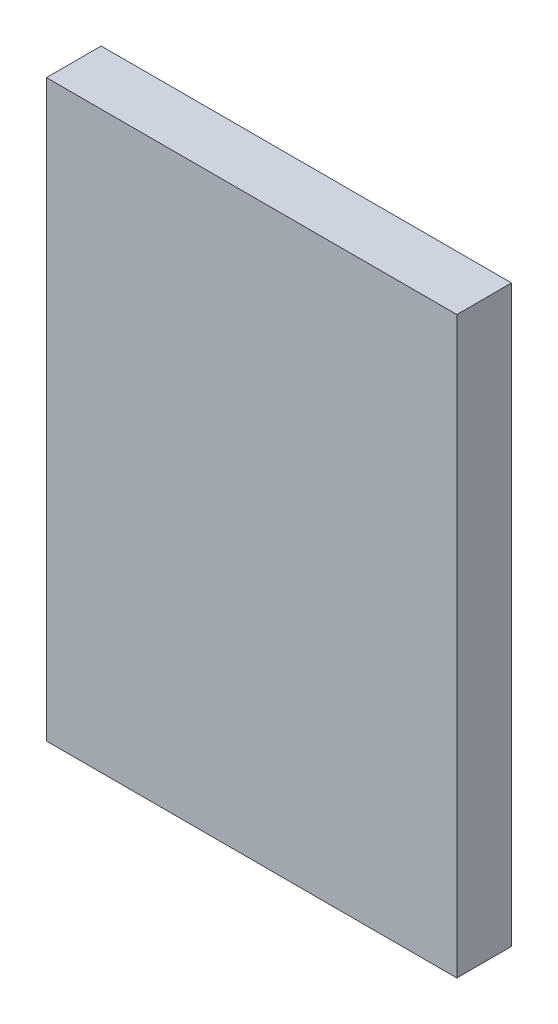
from build123d import *

# Parameters (mm, degrees)
BATTERY_USER_450MAH_30X42X4_START    = 5.85
BATTERY_USER_450MAH_30X42X4_SKETCH_W = 30
BATTERY_USER_450MAH_30X42X4_SKETCH_H = 42
BATTERY_USER_450MAH_30X42X4_DEPTH    = 4


with BuildPart() as part:
    # Battery_USER_450mAh_30x42x4_Sketch → Battery_USER_450mAh_30x42x4 (new body)
    with BuildSketch(Plane.XY.offset(BATTERY_USER_450MAH_30X42X4_START)):
        Rectangle(BATTERY_USER_450MAH_30X42X4_SKETCH_W, BATTERY_USER_450MAH_30X42X4_SKETCH_H)
    extrude(amount=BATTERY_USER_450MAH_30X42X4_DEPTH)


solid = part.part
